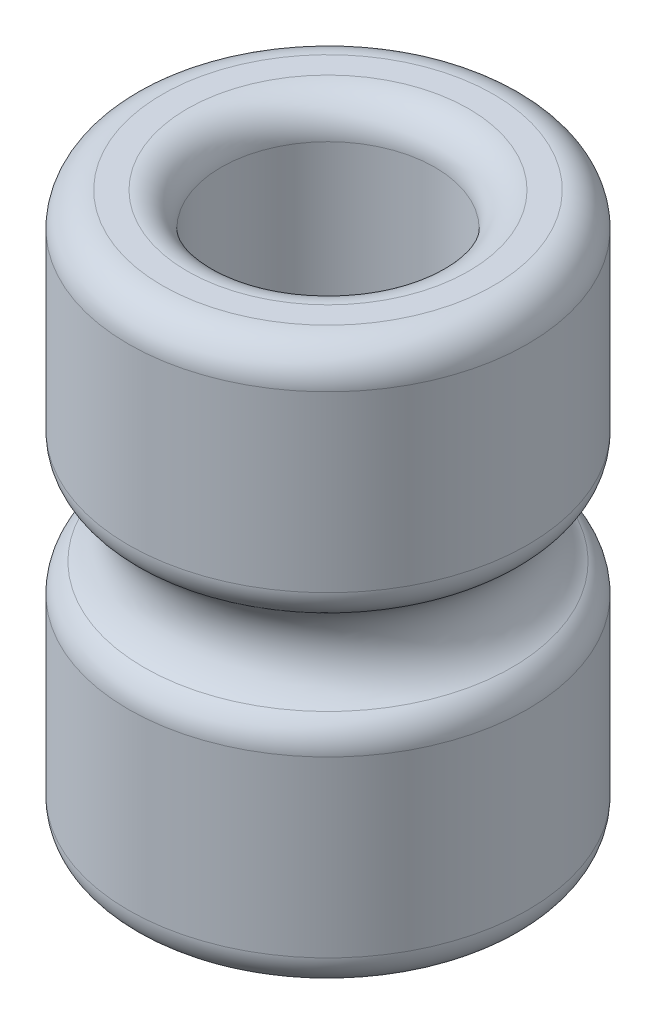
from build123d import *

# Parameters (mm, degrees)
SKETCH1_W          = 2.9972
SKETCH1_H          = 8.382
SKETCH2_R          = 1.60655
CUT_EXTRUDE1_DEPTH = 10.392781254
SKETCH3_R          = 0.762
FILLET1_R          = 0.508


with BuildPart() as part:
    # Sketch1 → Revolve1 (revolve)
    with BuildSketch(Plane.XY, mode=Mode.PRIVATE) as revolve1_sk:
        with Locations((1.4986, 0)):
            Rectangle(SKETCH1_W, SKETCH1_H)
    revolve(revolve1_sk.sketch.rotate(Axis((0, 0, 0), (0, 1, 0)), 90), axis=Axis((0, 0, 0), (0, 1, 0)))

    # Sketch2 → Cut-Extrude1 (cut, through all)
    with BuildSketch(Plane(origin=(0, 4.191, 0), x_dir=(1, 0, 0), z_dir=(0, 1, 0))):
        with Locations(Location((0, 0, 0), (0, 0, 270))):
            Circle(SKETCH2_R)
    extrude(amount=-CUT_EXTRUDE1_DEPTH, mode=Mode.SUBTRACT)

    # Sketch3 → Cut-Revolve1 (revolve, cut)
    with BuildSketch(Plane.XY, mode=Mode.PRIVATE) as cut_revolve1_sk:
        with Locations((3.175, 0)):
            Circle(SKETCH3_R)
    revolve(cut_revolve1_sk.sketch.rotate(Axis((0, 0, 0), (0, 1, 0)), 90), axis=Axis((0, 0, 0), (0, 1, 0)), mode=Mode.SUBTRACT)

    # Fillet1
    fillet1_edges = [part.edges().sort_by_distance(p)[0] for p in [
        (0, 0.740966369, 2.9972),
        (0, -0.740966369, 2.9972),
        (0, 4.191, 2.9972),
        (0, -4.191, 2.9972),
        (0, -4.191, -1.60655),
        (0, 4.191, -1.60655),
    ]]
    fillet(fillet1_edges, radius=FILLET1_R)


solid = part.part
